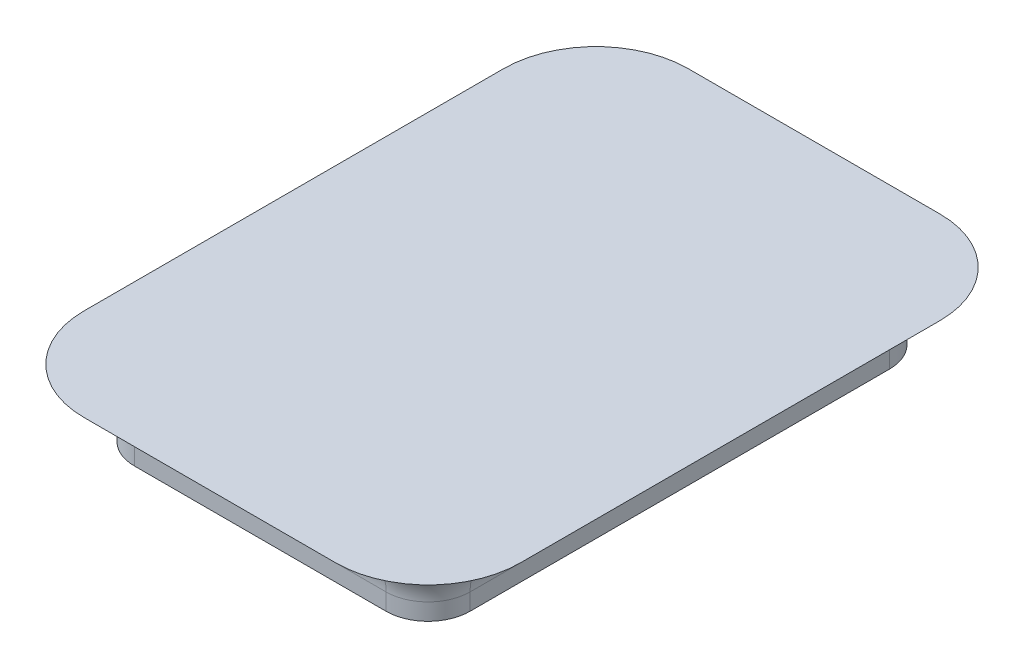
from build123d import *

# Parameters (mm, degrees)
SKETCH1_W           = 50
SKETCH1_H           = 5
BASE_EXTRUDE_DEPTH  = 25
SKETCH3_W           = 20
SKETCH3_H           = 4
BOSS_EXTRUDE1_DEPTH = 15
FILLET1_R           = 2.5
FILLET2_R           = 3
SKETCH4_W           = 50
SKETCH4_H           = 5
CUT_EXTRUDE1_DEPTH  = 57.124860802


with BuildPart() as part:
    # Sketch1 → Base-Extrude (new, symmetric)
    with BuildSketch(Plane.XY):
        with Locations((0, 2.5)):
            Rectangle(SKETCH1_W, SKETCH1_H)
    extrude(amount=BASE_EXTRUDE_DEPTH, both=True)

    # Sketch3 → Boss-Extrude1 (add, symmetric)
    with BuildSketch(Plane.XY):
        with Locations((0, -2)):
            Rectangle(SKETCH3_W, SKETCH3_H)
    extrude(amount=BOSS_EXTRUDE1_DEPTH, both=True)

    # Fillet1
    fillet1_edges = [part.edges().sort_by_distance(p)[0] for p in [
        (-10, -2, -15),
        (10, -2, -15),
        (-10, -2, 15),
        (10, -2, 15),
    ]]
    fillet(fillet1_edges, radius=FILLET1_R)

    # Fillet2
    fillet2_edges = [part.edges().sort_by_distance(p)[0] for p in [
        (0, 0, 15),
        (10, 0, 0),
        (-10, 0, 0),
        (0, 0, -15),
        (9.267766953, 0, 14.267766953),
        (-9.267766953, 0, 14.267766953),
        (-9.267766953, 0, -14.267766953),
        (9.267766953, 0, -14.267766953),
    ]]
    fillet(fillet2_edges, radius=FILLET2_R)

    # Sketch4 → Cut-Extrude1 (cut, through all)
    with BuildSketch(Plane(origin=(25, 0, 0), x_dir=(0, 0, -1), z_dir=(1, 0, 0))):
        with Locations((0, 2.5)):
            Rectangle(SKETCH4_W, SKETCH4_H)
    extrude(amount=-CUT_EXTRUDE1_DEPTH, mode=Mode.SUBTRACT)


solid = part.part
